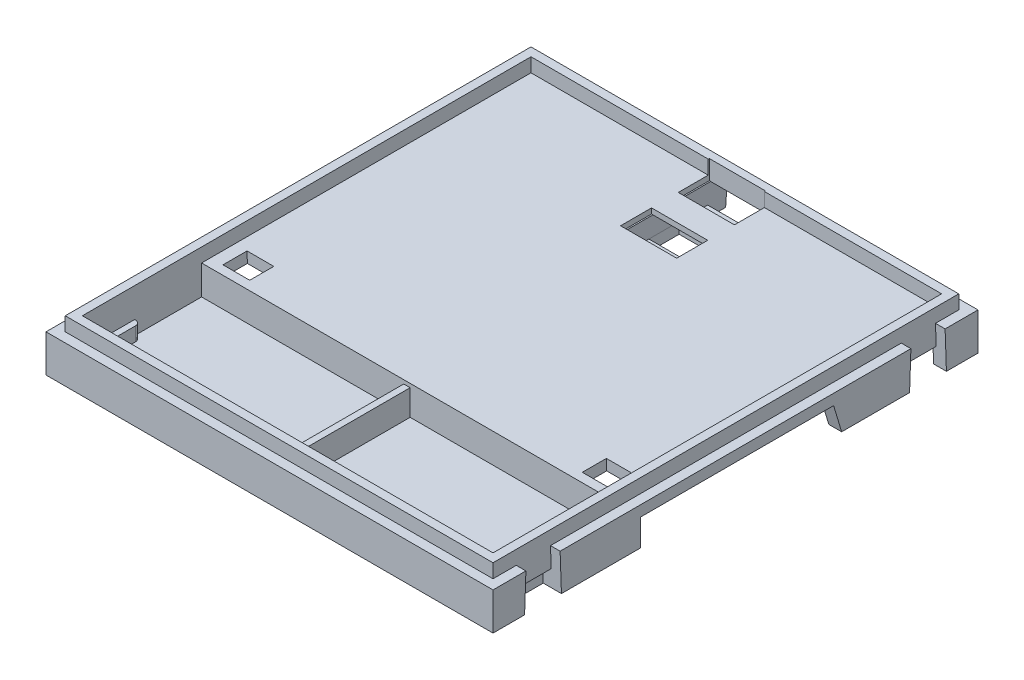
from build123d import *

# Parameters (mm, degrees)
SKETCH_1_W                = 83.6
SKETCH_1_H                = 90.7
EXTRUDE_1_DEPTH           = 7
SKETCH_2_W                = 80
SKETCH_2_H                = 87.1
EXTRUDE_2_DEPTH           = 2.6
SKETCH_3_W                = 76.8
SKETCH_3_H                = 22.3
CUT_EXTRUDE_1_DEPTH       = 5.5
SKETCH_4_W                = 1.2
SKETCH_4_H                = 22.3
EXTRUDE_3_DEPTH           = 4.8
SKETCH_5_W                = 1.1
SKETCH_5_H                = 2
EXTRUDE_4_DEPTH           = 4.7
EXTRUDE_5_DEPTH           = 2.6
CUT_EXTRUDE_2_DEPTH       = 1.8
CUT_EXTRUDE_3_DEPTH       = 5
CUT_EXTRUDE_4_DEPTH       = 52
CUT_EXTRUDE_5_DEPTH       = 3.5
CUT_EXTRUDE_6_DEPTH       = 0.6
EXTRUDE_6_DEPTH           = 1.8
CUT_EXTRUDE_7_REACH       = 69.058
CUT_EXTRUDE_8_DEPTH       = 1.6
EXTRUDE_7_DEPTH           = 0.7
EXTRUDE_8_DEPTH           = 3
SKETCH_17_W               = 10.5
SKETCH_17_H               = 5.8
CUT_EXTRUDE_9_DEPTH       = 1
SKETCH_18_W               = 10.789473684
SKETCH_18_H               = 5.8
CUT_EXTRUDE_10_DEPTH      = 2.2
CUT_EXTRUDE_11_DEPTH      = 96.365520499
CUT_EXTRUDE_12_DEPTH      = 4.3
CUT_EXTRUDE_12_DEPTH_BACK = 0.2
EXTRUDE_10_DEPTH          = 0.9
EXTRUDE_11_DEPTH          = 2.5
CUT_EXTRUDE_13_DEPTH      = 5


with BuildPart() as part:
    # Sketch 1 → Extrude 1 (new body)
    with BuildSketch(Plane(origin=(0, 0, 0), x_dir=(1, 0, 0), z_dir=(0, 1, 0))):
        Rectangle(SKETCH_1_W, SKETCH_1_H)
    extrude(amount=-EXTRUDE_1_DEPTH)

    # Sketch 2 → Extrude 2 (add)
    with BuildSketch(Plane(origin=(0, 0, 0), x_dir=(1, 0, 0), z_dir=(0, 1, 0))):
        Rectangle(SKETCH_2_W, SKETCH_2_H)
        Polygon((38.4, 41.95), (38.4, -41.95), (-38.4, -41.95), (-38.4, 41.95), (-5.25, 41.95), (-5.25, 42.15), (5.25, 42.15), (5.25, 41.95), align=None, mode=Mode.SUBTRACT)
    extrude(amount=EXTRUDE_2_DEPTH)

    # Sketch 3 → Cut-Extrude 1 (cut)
    with BuildSketch(Plane(origin=(0, 0, 0), x_dir=(1, 0, 0), z_dir=(0, 1, 0))):
        with Locations((0, -30.8)):
            Rectangle(SKETCH_3_W, SKETCH_3_H)
    extrude(amount=-CUT_EXTRUDE_1_DEPTH, mode=Mode.SUBTRACT)

    # Sketch 4 → Extrude 3 (add)
    with BuildSketch(Plane(origin=(0, -5.5, 0), x_dir=(1, 0, 0), z_dir=(0, 1, 0))):
        with Locations((0, -30.8)):
            Rectangle(SKETCH_4_W, SKETCH_4_H)
    extrude(amount=EXTRUDE_3_DEPTH)

    # Sketch 5 → Extrude 4 (add)
    with BuildSketch(Plane(origin=(0, -5.5, 0), x_dir=(1, 0, 0), z_dir=(0, 1, 0))):
        with Locations((-10, -40.95)):
            Rectangle(SKETCH_5_W, SKETCH_5_H)
        with Locations((-29.15, -40.95)):
            Rectangle(SKETCH_5_W, SKETCH_5_H)
        with Locations((10, -40.95)):
            Rectangle(SKETCH_5_W, SKETCH_5_H)
        with Locations((29.15, -40.95)):
            Rectangle(SKETCH_5_W, SKETCH_5_H)
    extrude(amount=EXTRUDE_4_DEPTH)

    # Sketch 6 → Extrude 5 (add)
    with BuildSketch(Plane(origin=(0, -5.5, 0), x_dir=(1, 0, 0), z_dir=(0, 1, 0))):
        with BuildLine():
            Line((-38.4, -32.15), (-38.3, -32.15))
            ThreePointArc((-38.3, -32.15), (-37.592893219, -32.442893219), (-37.3, -33.15))
            Line((-37.3, -33.15), (-37.3, -38.85))
            ThreePointArc((-37.3, -38.85), (-37.592893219, -39.557106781), (-38.3, -39.85))
            Line((-38.3, -39.85), (-38.4, -39.85))
            Line((-38.4, -39.85), (-38.4, -32.15))
        make_face()
        with BuildLine():
            Line((38.4, -32.15), (38.3, -32.15))
            ThreePointArc((38.3, -32.15), (37.592893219, -32.442893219), (37.3, -33.15))
            Line((37.3, -33.15), (37.3, -38.85))
            ThreePointArc((37.3, -38.85), (37.592893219, -39.557106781), (38.3, -39.85))
            Line((38.3, -39.85), (38.4, -39.85))
            Line((38.4, -39.85), (38.4, -32.15))
        make_face()
    extrude(amount=EXTRUDE_5_DEPTH)

    # Sketch 7 → Cut-Extrude 2 (cut)
    with BuildSketch(Plane.ZY.offset(41.8)):
        Polygon((-39.2, 0), (-39.444445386, -7), (-32.555554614, -7), (-32.8, 0), align=None)
        Polygon((32.555554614, -7), (32.8, 0), (39.2, 0), (39.444445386, -7), align=None)
    cut_extrude_2 = extrude(amount=-CUT_EXTRUDE_2_DEPTH, mode=Mode.SUBTRACT)

    # Mirror 2: Cut-Extrude 2 across plane
    add(cut_extrude_2.mirror(Plane(origin=(0, 0, 0), x_dir=(0, 0, 1), z_dir=(1, 0, 0))), mode=Mode.SUBTRACT)

    # Sketch 8 → Cut-Extrude 3 (cut)
    with BuildSketch(Plane.XZ.offset(7)):
        Polygon((-41.8, 17.75), (41.8, 17.75), (41.8, -18.35), (39.4, -18.35), (39.4, -43.35), (7.1, -43.35), (7.1, -24.75), (-7.1, -24.75), (-7.1, -43.35), (-39.4, -43.35), (-39.4, -18.35), (-41.8, -18.35), align=None)
    extrude(amount=-CUT_EXTRUDE_3_DEPTH, mode=Mode.SUBTRACT)

    # Sketch 9 → Cut-Extrude 4 (cut)
    with BuildSketch(Plane(origin=(0, 0, -45.35), x_dir=(-1, 0, 0), z_dir=(0, 0, -1))):
        Polygon((-5, -1), (5, -1), (5.25, -4.8), (-5.25, -4.8), align=None)
    extrude(amount=-CUT_EXTRUDE_4_DEPTH, mode=Mode.SUBTRACT)

    # Sketch 10 → Cut-Extrude 5 (cut)
    with BuildSketch(Plane(origin=(0, 0, -45.35), x_dir=(-1, 0, 0), z_dir=(0, 0, -1))):
        Polygon((-5.25, -4.8), (5.25, -4.8), (5.394736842, -7), (-5.394736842, -7), align=None)
    extrude(amount=-CUT_EXTRUDE_5_DEPTH, mode=Mode.SUBTRACT)

    # Sketch 11 → Cut-Extrude 6 (cut)
    with BuildSketch(Plane(origin=(40, 0, 0), x_dir=(0, 0, -1), z_dir=(1, 0, 0))):
        Polygon((32.555554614, -7), (39.444445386, -7), (39.269841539, -2), (32.730158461, -2), align=None)
    cut_extrude_6 = extrude(amount=-CUT_EXTRUDE_6_DEPTH, mode=Mode.SUBTRACT)

    # Sketch 12 → Extrude 6 (add)
    with BuildSketch(Plane.XZ.offset(2)):
        with BuildLine():
            Line((39.4, -31.7), (40, -31.7))
            Line((40, -31.7), (40, -40.3))
            Line((40, -40.3), (39.4, -40.3))
            ThreePointArc((39.4, -40.3), (38.692893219, -40.007106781), (38.4, -39.3))
            Line((38.4, -39.3), (38.4, -32.7))
            ThreePointArc((38.4, -32.7), (38.692893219, -31.992893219), (39.4, -31.7))
        make_face()
    extrude_6 = extrude(amount=EXTRUDE_6_DEPTH)

    # Cut-Extrude 7: up to this face of the body (flat: up to its plane)
    cut_extrude_7_end = Plane(part.part.faces().sort_by_distance((7.1, -4.5, -34.05))[0])
    # Sketch 13 → Cut-Extrude 7 (cut, up to the picked face)
    with BuildSketch(Plane.ZY.offset(7.1), mode=Mode.PRIVATE) as cut_extrude_7_sk1:
        Polygon((-24.75, -7), (-24.75, -2), (-25.25, -7), align=None)
    cut_extrude_7_tool1 = split(extrude(cut_extrude_7_sk1.sketch, amount=-CUT_EXTRUDE_7_REACH, mode=Mode.PRIVATE), bisect_by=cut_extrude_7_end, keep=Keep.BOTH, mode=Mode.PRIVATE)
    add(cut_extrude_7_tool1.solids().sort_by(Axis((-7.1, -5.333333, -24.916667), (1, 0, 0)))[0], mode=Mode.SUBTRACT)

    # Sketch 14 → Cut-Extrude 8 (cut)
    with BuildSketch(Plane(origin=(40, 0, 0), x_dir=(0, 0, -1), z_dir=(1, 0, 0))):
        Polygon((-39.444445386, -7), (-32.555554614, -7), (-32.667301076, -3.8), (-39.332698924, -3.8), align=None)
    cut_extrude_8 = extrude(amount=-CUT_EXTRUDE_8_DEPTH, mode=Mode.SUBTRACT)

    # Mirror 3: Cut-Extrude 6, Extrude 6, Cut-Extrude 8 across plane
    add(cut_extrude_6.mirror(Plane(origin=(0, 0, 0), x_dir=(0, 0, 1), z_dir=(1, 0, 0))), mode=Mode.SUBTRACT)
    add(extrude_6.mirror(Plane(origin=(0, 0, 0), x_dir=(0, 0, 1), z_dir=(1, 0, 0))))
    add(cut_extrude_8.mirror(Plane(origin=(0, 0, 0), x_dir=(0, 0, 1), z_dir=(1, 0, 0))), mode=Mode.SUBTRACT)

    # Sketch 15 → Extrude 7 (add)
    with BuildSketch(Plane.XZ.offset(2)):
        with BuildLine():
            Line((-26.3, 15.55), (-11.3, 15.55))
            ThreePointArc((-11.3, 15.55), (-10.3, 14.55), (-11.3, 13.55))
            Line((-11.3, 13.55), (-26.3, 13.55))
            ThreePointArc((-26.3, 13.55), (-27.3, 14.55), (-26.3, 15.55))
        make_face()
        with BuildLine():
            Line((11.3, 15.55), (26.3, 15.55))
            ThreePointArc((26.3, 15.55), (27.3, 14.55), (26.3, 13.55))
            Line((26.3, 13.55), (11.3, 13.55))
            ThreePointArc((11.3, 13.55), (10.3, 14.55), (11.3, 15.55))
        make_face()
    extrude(amount=EXTRUDE_7_DEPTH)

    # Sketch 16 → Extrude 8 (add)
    with BuildSketch(Plane.XZ.offset(2)):
        with BuildLine():
            Line((-12.1, -23.35), (-12.1, -23.85))
            ThreePointArc((-12.1, -23.85), (-13.6, -25.35), (-15.1, -23.85))
            Line((-15.1, -23.85), (-15.1, -23.35))
            ThreePointArc((-15.1, -23.35), (-13.6, -21.85), (-12.1, -23.35))
        make_face()
        with BuildLine():
            Line((15.1, -23.35), (15.1, -23.85))
            ThreePointArc((15.1, -23.85), (13.6, -25.35), (12.1, -23.85))
            Line((12.1, -23.85), (12.1, -23.35))
            ThreePointArc((12.1, -23.35), (13.6, -21.85), (15.1, -23.35))
        make_face()
    extrude(amount=EXTRUDE_8_DEPTH)

    # Sketch 17 → Cut-Extrude 9 (cut)
    with BuildSketch(Plane(origin=(0, 0, 0), x_dir=(1, 0, 0), z_dir=(0, 1, 0))):
        with Locations((0, 39.25)):
            Rectangle(SKETCH_17_W, SKETCH_17_H)
        with Locations((0, 28.45)):
            Rectangle(SKETCH_17_W, SKETCH_17_H)
    extrude(amount=-CUT_EXTRUDE_9_DEPTH, mode=Mode.SUBTRACT)

    # Sketch 18 → Cut-Extrude 10 (cut)
    with BuildSketch(Plane.XZ.offset(7)):
        with Locations((0, -33.75)):
            Rectangle(SKETCH_18_W, SKETCH_18_H)
    extrude(amount=-CUT_EXTRUDE_10_DEPTH, mode=Mode.SUBTRACT)

    # Sketch 19 → Cut-Extrude 11 (cut, through all)
    with BuildSketch(Plane(origin=(41.8, 0, 0), x_dir=(0, 0, -1), z_dir=(1, 0, 0))):
        Polygon((18.35, -2), (18.35, -7), (19.85, -7), align=None)
    extrude(amount=-CUT_EXTRUDE_11_DEPTH, mode=Mode.SUBTRACT)

    # Sketch 20 → Cut-Extrude 12 (cut, two sides: drawn at the far end of the back side and taken through both)
    with BuildSketch(Plane(origin=(0, 0, 17.75), x_dir=(-1, 0, 0), z_dir=(0, 0, -1)).offset(-CUT_EXTRUDE_12_DEPTH_BACK)):
        Polygon((-36.1, 0), (-35.9, -7), (-31.3, -7), (-31.1, 0), align=None)
        Polygon((31.1, 0), (31.3, -7), (35.9, -7), (36.1, 0), align=None)
    extrude(amount=CUT_EXTRUDE_12_DEPTH + CUT_EXTRUDE_12_DEPTH_BACK, mode=Mode.SUBTRACT)

    # Sketch 22 → Extrude 10 (add, symmetric)
    with BuildSketch(Plane(origin=(-33.6, -6, 0), x_dir=(0, 0, -1), z_dir=(1, 0, 0))):
        Polygon((-17.95, -1), (-17.95, 2.8), (-15.35, 2.2), (-15.35, -1), align=None)
    extrude_10 = extrude(amount=EXTRUDE_10_DEPTH, both=True)

    # Sketch 24 → Extrude 11 (add, symmetric)
    with BuildSketch(Plane(origin=(-33.6, -6, 0), x_dir=(0, 0, -1), z_dir=(1, 0, 0))):
        Polygon((-17.95, 2.6), (-15.25, 1), (-15.25, -1), (-17.95, -1), align=None)
    extrude_11 = extrude(amount=EXTRUDE_11_DEPTH, both=True)

    # Sketch 25 → Cut-Extrude 13 (cut)
    with BuildSketch(Plane(origin=(0, 0, 17.75), x_dir=(-1, 0, 0), z_dir=(0, 0, -1))):
        Polygon((31.197142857, -3.4), (31.3, -7), (30.49754973, -7), (30.49754973, -3.4), align=None)
        Polygon((36.002857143, -3.4), (35.9, -7), (36.741621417, -7), (36.741621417, -3.4), align=None)
    cut_extrude_13 = extrude(amount=CUT_EXTRUDE_13_DEPTH, mode=Mode.SUBTRACT)

    # Mirror 4: Extrude 10, Extrude 11, Cut-Extrude 13 across plane
    add(extrude_10.mirror(Plane(origin=(0, 0, 0), x_dir=(0, 0, 1), z_dir=(1, 0, 0))))
    add(extrude_11.mirror(Plane(origin=(0, 0, 0), x_dir=(0, 0, 1), z_dir=(1, 0, 0))))
    add(cut_extrude_13.mirror(Plane(origin=(0, 0, 0), x_dir=(0, 0, 1), z_dir=(1, 0, 0))), mode=Mode.SUBTRACT)


solid = part.part
